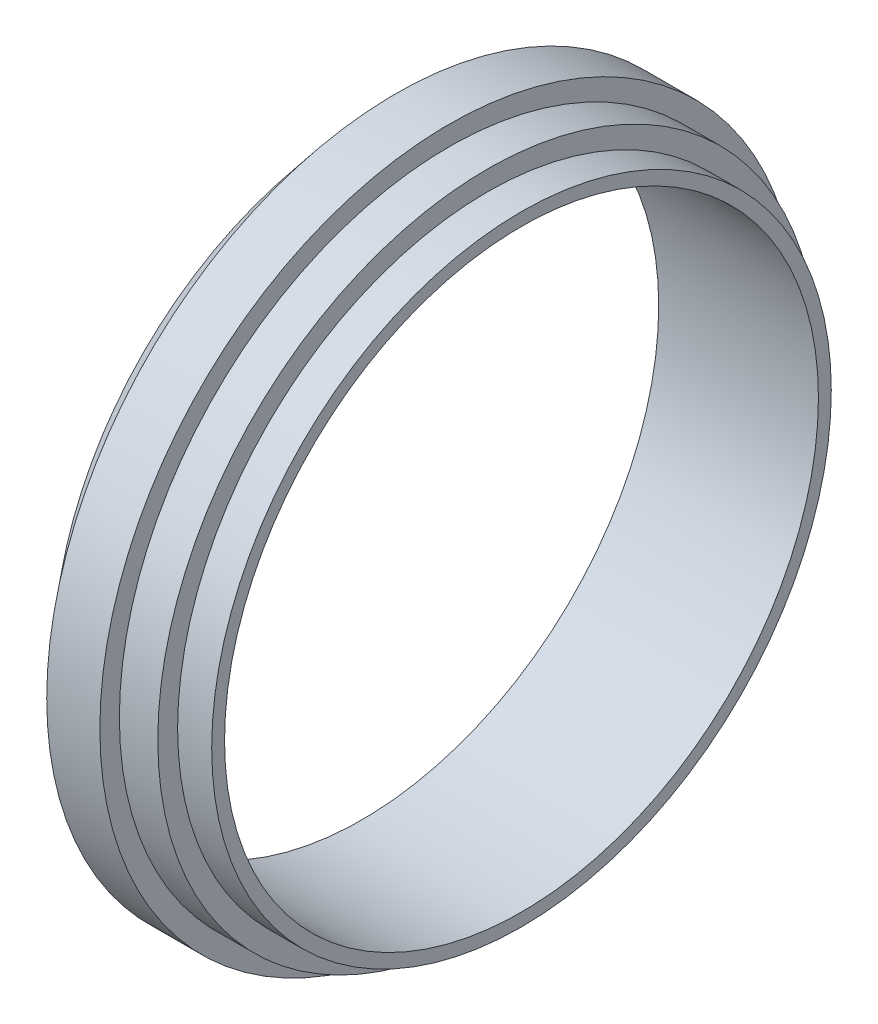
from build123d import *

# Parameters (mm, degrees)
SKETCH4_R          = 48.6918
CUT_EXTRUDE1_DEPTH = 126.054683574


with BuildPart() as part:
    # Sketch1 → Revolve1 (revolve)
    with BuildSketch(Plane.XY, mode=Mode.PRIVATE) as revolve1_sk:
        Polygon((0, 0), (-5.588, 0), (-5.588, -3.2512), (-11.8872, -3.2512), (-11.8872, -6.4516), (-20.5994, -6.4516), (-26.1874, 0.3048), (-26.1874, 50.8), (0, 50.8), align=None)
    revolve(revolve1_sk.sketch.rotate(Axis((-26.1874, 50.8, 0), (1, 0, 0)), 270), axis=Axis((-26.1874, 50.8, 0), (1, 0, 0)))

    # Sketch4 → Cut-Extrude1 (cut, through all)
    with BuildSketch(Plane.ZY.offset(26.1874)):
        with Locations((0, 50.8)):
            Circle(SKETCH4_R)
    extrude(amount=-CUT_EXTRUDE1_DEPTH, mode=Mode.SUBTRACT)


solid = part.part
